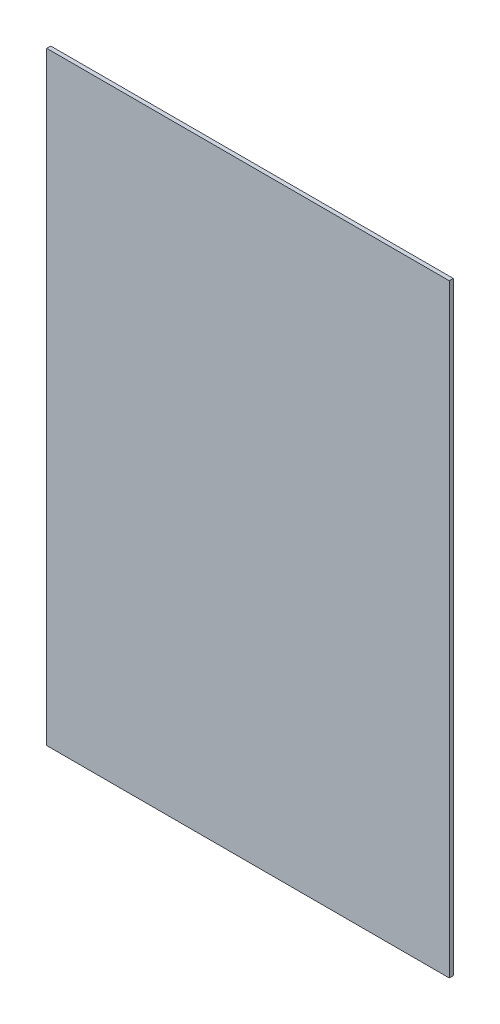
ISO-10303-21;
HEADER;
FILE_DESCRIPTION(('STEP AP214'),'2;1');
FILE_NAME('part.step','',(''),(''),'','','');
FILE_SCHEMA(('AUTOMOTIVE_DESIGN { 1 0 10303 214 1 1 1 1 }'));
ENDSEC;
DATA;
#1=APPLICATION_CONTEXT('core data for automotive mechanical design processes');
#2=APPLICATION_PROTOCOL_DEFINITION('international standard','automotive_design',2000,#1);
#3=PRODUCT_CONTEXT('',#1,'mechanical');
#4=PRODUCT('Part','Part','',(#3));
#5=PRODUCT_RELATED_PRODUCT_CATEGORY('part','',(#4));
#6=PRODUCT_DEFINITION_FORMATION('','',#4);
#7=PRODUCT_DEFINITION_CONTEXT('part definition',#1,'design');
#8=PRODUCT_DEFINITION('design','',#6,#7);
#9=PRODUCT_DEFINITION_SHAPE('','',#8);
#10=(LENGTH_UNIT() NAMED_UNIT(*) SI_UNIT(.MILLI.,.METRE.));
#11=(NAMED_UNIT(*) PLANE_ANGLE_UNIT() SI_UNIT($,.RADIAN.));
#12=(NAMED_UNIT(*) SI_UNIT($,.STERADIAN.) SOLID_ANGLE_UNIT());
#13=UNCERTAINTY_MEASURE_WITH_UNIT(LENGTH_MEASURE(1.E-05),#10,'distance_accuracy_value','');
#14=(GEOMETRIC_REPRESENTATION_CONTEXT(3) GLOBAL_UNCERTAINTY_ASSIGNED_CONTEXT((#13)) GLOBAL_UNIT_ASSIGNED_CONTEXT((#10,
#11,#12)) REPRESENTATION_CONTEXT('',''));
#15=CARTESIAN_POINT('',(0.,0.,0.));
#16=DIRECTION('',(0.,0.,1.));
#17=DIRECTION('',(1.,0.,0.));
#18=AXIS2_PLACEMENT_3D('',#15,#16,#17);
#19=CARTESIAN_POINT('',(-124.488412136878,1255.92052489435,8.));
#20=DIRECTION('',(1.,0.,0.));
#21=DIRECTION('',(0.,1.,0.));
#22=AXIS2_PLACEMENT_3D('',#19,#20,#21);
#23=PLANE('',#22);
#24=DIRECTION('',(0.,-1.,0.));
#25=VECTOR('',#24,1.);
#26=CARTESIAN_POINT('',(-124.488412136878,1255.92052489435,0.));
#27=LINE('',#26,#25);
#28=CARTESIAN_POINT('',(-124.488412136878,1255.92052489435,0.));
#29=VERTEX_POINT('',#28);
#30=CARTESIAN_POINT('',(-124.488412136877,55.920524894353,0.));
#31=VERTEX_POINT('',#30);
#32=EDGE_CURVE('E96',#29,#31,#27,.T.);
#33=ORIENTED_EDGE('',*,*,#32,.T.);
#34=DIRECTION('',(0.,0.,-1.));
#35=VECTOR('',#34,1.);
#36=CARTESIAN_POINT('',(-124.488412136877,55.920524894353,8.));
#37=LINE('',#36,#35);
#38=CARTESIAN_POINT('',(-124.488412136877,55.920524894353,8.));
#39=VERTEX_POINT('',#38);
#40=EDGE_CURVE('E11',#39,#31,#37,.T.);
#41=ORIENTED_EDGE('',*,*,#40,.F.);
#42=DIRECTION('',(0.,-1.,0.));
#43=VECTOR('',#42,1.);
#44=CARTESIAN_POINT('',(-124.488412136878,1255.92052489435,8.));
#45=LINE('',#44,#43);
#46=CARTESIAN_POINT('',(-124.488412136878,1255.92052489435,8.));
#47=VERTEX_POINT('',#46);
#48=EDGE_CURVE('E84',#47,#39,#45,.T.);
#49=ORIENTED_EDGE('',*,*,#48,.F.);
#50=DIRECTION('',(0.,0.,-1.));
#51=VECTOR('',#50,1.);
#52=CARTESIAN_POINT('',(-124.488412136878,1255.92052489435,8.));
#53=LINE('',#52,#51);
#54=EDGE_CURVE('E92',#47,#29,#53,.T.);
#55=ORIENTED_EDGE('',*,*,#54,.T.);
#56=EDGE_LOOP('',(#33,#41,#49,#55));
#57=FACE_BOUND('',#56,.T.);
#58=ADVANCED_FACE('F33',(#57),#23,.F.);
#59=CARTESIAN_POINT('',(-124.488412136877,55.920524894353,8.));
#60=DIRECTION('',(0.,1.,0.));
#61=DIRECTION('',(0.,0.,1.));
#62=AXIS2_PLACEMENT_3D('',#59,#60,#61);
#63=PLANE('',#62);
#64=DIRECTION('',(1.,0.,0.));
#65=VECTOR('',#64,1.);
#66=CARTESIAN_POINT('',(-124.488412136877,55.920524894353,0.));
#67=LINE('',#66,#65);
#68=CARTESIAN_POINT('',(675.511587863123,55.920524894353,0.));
#69=VERTEX_POINT('',#68);
#70=EDGE_CURVE('E88',#31,#69,#67,.T.);
#71=ORIENTED_EDGE('',*,*,#70,.T.);
#72=DIRECTION('',(0.,0.,-1.));
#73=VECTOR('',#72,1.);
#74=CARTESIAN_POINT('',(675.511587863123,55.920524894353,8.));
#75=LINE('',#74,#73);
#76=CARTESIAN_POINT('',(675.511587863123,55.920524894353,8.));
#77=VERTEX_POINT('',#76);
#78=EDGE_CURVE('E41',#77,#69,#75,.T.);
#79=ORIENTED_EDGE('',*,*,#78,.F.);
#80=DIRECTION('',(1.,0.,0.));
#81=VECTOR('',#80,1.);
#82=CARTESIAN_POINT('',(-124.488412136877,55.920524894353,8.));
#83=LINE('',#82,#81);
#84=EDGE_CURVE('E79',#39,#77,#83,.T.);
#85=ORIENTED_EDGE('',*,*,#84,.F.);
#86=ORIENTED_EDGE('',*,*,#40,.T.);
#87=EDGE_LOOP('',(#71,#79,#85,#86));
#88=FACE_BOUND('',#87,.T.);
#89=ADVANCED_FACE('F87',(#88),#63,.F.);
#90=CARTESIAN_POINT('',(675.511587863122,1255.92052489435,8.));
#91=DIRECTION('',(-1.,0.,0.));
#92=DIRECTION('',(0.,-1.,0.));
#93=AXIS2_PLACEMENT_3D('',#90,#91,#92);
#94=PLANE('',#93);
#95=DIRECTION('',(0.,1.,0.));
#96=VECTOR('',#95,1.);
#97=CARTESIAN_POINT('',(675.511587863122,1255.92052489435,0.));
#98=LINE('',#97,#96);
#99=CARTESIAN_POINT('',(675.511587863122,1255.92052489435,0.));
#100=VERTEX_POINT('',#99);
#101=EDGE_CURVE('E66',#69,#100,#98,.T.);
#102=ORIENTED_EDGE('',*,*,#101,.T.);
#103=DIRECTION('',(0.,0.,-1.));
#104=VECTOR('',#103,1.);
#105=CARTESIAN_POINT('',(675.511587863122,1255.92052489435,8.));
#106=LINE('',#105,#104);
#107=CARTESIAN_POINT('',(675.511587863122,1255.92052489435,8.));
#108=VERTEX_POINT('',#107);
#109=EDGE_CURVE('E89',#108,#100,#106,.T.);
#110=ORIENTED_EDGE('',*,*,#109,.F.);
#111=DIRECTION('',(0.,1.,0.));
#112=VECTOR('',#111,1.);
#113=CARTESIAN_POINT('',(675.511587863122,1255.92052489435,8.));
#114=LINE('',#113,#112);
#115=EDGE_CURVE('E82',#77,#108,#114,.T.);
#116=ORIENTED_EDGE('',*,*,#115,.F.);
#117=ORIENTED_EDGE('',*,*,#78,.T.);
#118=EDGE_LOOP('',(#102,#110,#116,#117));
#119=FACE_BOUND('',#118,.T.);
#120=ADVANCED_FACE('F90',(#119),#94,.F.);
#121=CARTESIAN_POINT('',(-124.488412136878,1255.92052489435,8.));
#122=DIRECTION('',(0.,-1.,0.));
#123=DIRECTION('',(0.,0.,-1.));
#124=AXIS2_PLACEMENT_3D('',#121,#122,#123);
#125=PLANE('',#124);
#126=DIRECTION('',(-1.,0.,0.));
#127=VECTOR('',#126,1.);
#128=CARTESIAN_POINT('',(-124.488412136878,1255.92052489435,0.));
#129=LINE('',#128,#127);
#130=EDGE_CURVE('E72',#100,#29,#129,.T.);
#131=ORIENTED_EDGE('',*,*,#130,.T.);
#132=ORIENTED_EDGE('',*,*,#54,.F.);
#133=DIRECTION('',(-1.,0.,0.));
#134=VECTOR('',#133,1.);
#135=CARTESIAN_POINT('',(-124.488412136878,1255.92052489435,8.));
#136=LINE('',#135,#134);
#137=EDGE_CURVE('E49',#108,#47,#136,.T.);
#138=ORIENTED_EDGE('',*,*,#137,.F.);
#139=ORIENTED_EDGE('',*,*,#109,.T.);
#140=EDGE_LOOP('',(#131,#132,#138,#139));
#141=FACE_BOUND('',#140,.T.);
#142=ADVANCED_FACE('F103',(#141),#125,.F.);
#143=CARTESIAN_POINT('',(0.,0.,8.));
#144=DIRECTION('',(0.,0.,1.));
#145=DIRECTION('',(1.,0.,0.));
#146=AXIS2_PLACEMENT_3D('',#143,#144,#145);
#147=PLANE('',#146);
#148=ORIENTED_EDGE('',*,*,#48,.T.);
#149=ORIENTED_EDGE('',*,*,#84,.T.);
#150=ORIENTED_EDGE('',*,*,#115,.T.);
#151=ORIENTED_EDGE('',*,*,#137,.T.);
#152=EDGE_LOOP('',(#148,#149,#150,#151));
#153=FACE_BOUND('',#152,.T.);
#154=ADVANCED_FACE('F80',(#153),#147,.T.);
#155=CARTESIAN_POINT('',(0.,0.,0.));
#156=DIRECTION('',(0.,0.,1.));
#157=DIRECTION('',(1.,0.,0.));
#158=AXIS2_PLACEMENT_3D('',#155,#156,#157);
#159=PLANE('',#158);
#160=ORIENTED_EDGE('',*,*,#32,.F.);
#161=ORIENTED_EDGE('',*,*,#130,.F.);
#162=ORIENTED_EDGE('',*,*,#101,.F.);
#163=ORIENTED_EDGE('',*,*,#70,.F.);
#164=EDGE_LOOP('',(#160,#161,#162,#163));
#165=FACE_BOUND('',#164,.T.);
#166=ADVANCED_FACE('F106',(#165),#159,.F.);
#167=CLOSED_SHELL('',(#58,#89,#120,#142,#154,#166));
#168=MANIFOLD_SOLID_BREP('B2',#167);
#169=ADVANCED_BREP_SHAPE_REPRESENTATION('',(#18,#168),#14);
#170=SHAPE_DEFINITION_REPRESENTATION(#9,#169);
ENDSEC;
END-ISO-10303-21;
